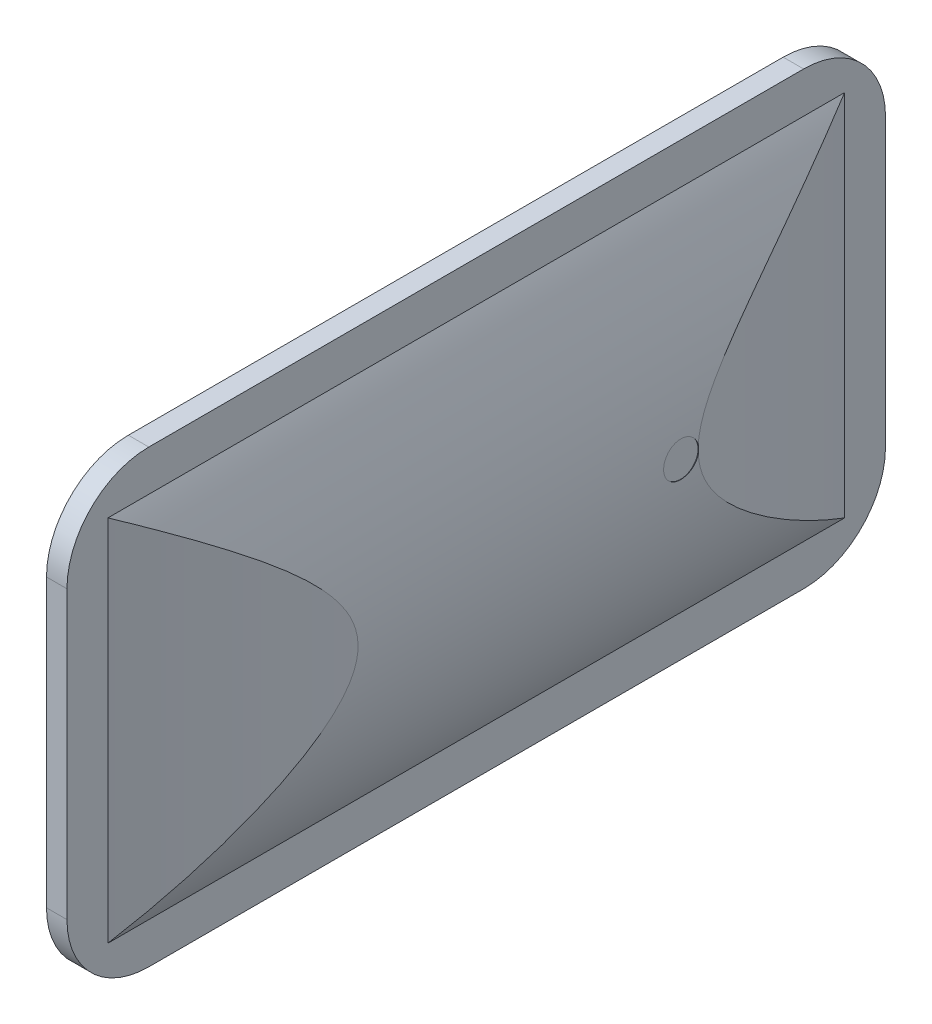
ISO-10303-21;
HEADER;
FILE_DESCRIPTION(('STEP AP214'),'2;1');
FILE_NAME('part.step','',(''),(''),'','','');
FILE_SCHEMA(('AUTOMOTIVE_DESIGN { 1 0 10303 214 1 1 1 1 }'));
ENDSEC;
DATA;
#1=APPLICATION_CONTEXT('core data for automotive mechanical design processes');
#2=APPLICATION_PROTOCOL_DEFINITION('international standard','automotive_design',2000,#1);
#3=PRODUCT_CONTEXT('',#1,'mechanical');
#4=PRODUCT('Part','Part','',(#3));
#5=PRODUCT_RELATED_PRODUCT_CATEGORY('part','',(#4));
#6=PRODUCT_DEFINITION_FORMATION('','',#4);
#7=PRODUCT_DEFINITION_CONTEXT('part definition',#1,'design');
#8=PRODUCT_DEFINITION('design','',#6,#7);
#9=PRODUCT_DEFINITION_SHAPE('','',#8);
#10=(LENGTH_UNIT() NAMED_UNIT(*) SI_UNIT(.MILLI.,.METRE.));
#11=(NAMED_UNIT(*) PLANE_ANGLE_UNIT() SI_UNIT($,.RADIAN.));
#12=(NAMED_UNIT(*) SI_UNIT($,.STERADIAN.) SOLID_ANGLE_UNIT());
#13=UNCERTAINTY_MEASURE_WITH_UNIT(LENGTH_MEASURE(1.E-05),#10,'distance_accuracy_value','');
#14=(GEOMETRIC_REPRESENTATION_CONTEXT(3) GLOBAL_UNCERTAINTY_ASSIGNED_CONTEXT((#13)) GLOBAL_UNIT_ASSIGNED_CONTEXT((#10,
#11,#12)) REPRESENTATION_CONTEXT('',''));
#15=CARTESIAN_POINT('',(0.,0.,0.));
#16=DIRECTION('',(0.,0.,1.));
#17=DIRECTION('',(1.,0.,0.));
#18=AXIS2_PLACEMENT_3D('',#15,#16,#17);
#19=CARTESIAN_POINT('',(-90.1804598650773,69.8499999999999,254.));
#20=DIRECTION('',(0.,0.,-1.));
#21=DIRECTION('',(-1.,0.,0.));
#22=AXIS2_PLACEMENT_3D('',#19,#20,#21);
#23=CYLINDRICAL_SURFACE('',#22,109.459418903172);
#24=CARTESIAN_POINT('',(19.2789590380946,69.85,84.9582497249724));
#25=CARTESIAN_POINT('',(19.2789592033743,70.0033260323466,84.95825092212));
#26=CARTESIAN_POINT('',(19.2786362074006,70.156632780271,84.9517898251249));
#27=CARTESIAN_POINT('',(19.2773535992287,70.4622063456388,84.925991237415));
#28=CARTESIAN_POINT('',(19.2763938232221,70.6144728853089,84.9066504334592));
#29=CARTESIAN_POINT('',(19.2738633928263,70.9169622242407,84.855203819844));
#30=CARTESIAN_POINT('',(19.2722922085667,71.067183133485,84.8230869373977));
#31=CARTESIAN_POINT('',(19.2685829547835,71.364435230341,84.7463047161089));
#32=CARTESIAN_POINT('',(19.2664446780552,71.5114652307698,84.701634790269));
#33=CARTESIAN_POINT('',(19.2616642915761,71.8011046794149,84.6001156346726));
#34=CARTESIAN_POINT('',(19.2590226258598,71.9437178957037,84.5432771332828));
#35=CARTESIAN_POINT('',(19.2533080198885,72.223699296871,84.4177797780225));
#36=CARTESIAN_POINT('',(19.2502349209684,72.3610655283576,84.3491165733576));
#37=CARTESIAN_POINT('',(19.2437472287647,72.6294419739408,84.2005183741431));
#38=CARTESIAN_POINT('',(19.2403328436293,72.7604559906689,84.1205902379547));
#39=CARTESIAN_POINT('',(19.2332563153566,73.0153374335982,83.9499666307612));
#40=CARTESIAN_POINT('',(19.2295940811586,73.1392022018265,83.8592671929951));
#41=CARTESIAN_POINT('',(19.222124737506,73.3789176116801,83.6677187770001));
#42=CARTESIAN_POINT('',(19.2183175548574,73.4947641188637,83.5668646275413));
#43=CARTESIAN_POINT('',(19.2106665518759,73.7175940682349,83.3557215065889));
#44=CARTESIAN_POINT('',(19.2068227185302,73.8245742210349,83.2454290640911));
#45=CARTESIAN_POINT('',(19.1992100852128,74.0288315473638,83.0162609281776));
#46=CARTESIAN_POINT('',(19.1954412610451,74.1261118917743,82.8973880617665));
#47=CARTESIAN_POINT('',(19.1880828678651,74.3103534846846,82.6518239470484));
#48=CARTESIAN_POINT('',(19.1844933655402,74.3973109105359,82.525129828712));
#49=CARTESIAN_POINT('',(19.1775965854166,74.5602580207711,82.2648421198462));
#50=CARTESIAN_POINT('',(19.1742893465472,74.6362461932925,82.1312475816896));
#51=CARTESIAN_POINT('',(19.1680504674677,74.7767250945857,81.858076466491));
#52=CARTESIAN_POINT('',(19.1651189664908,74.841211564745,81.7184976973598));
#53=CARTESIAN_POINT('',(19.1597176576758,74.9581703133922,81.4344353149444));
#54=CARTESIAN_POINT('',(19.157247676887,75.0106470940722,81.2899535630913));
#55=CARTESIAN_POINT('',(19.1528369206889,75.1032576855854,80.9970633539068));
#56=CARTESIAN_POINT('',(19.1508963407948,75.1433869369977,80.8486534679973));
#57=CARTESIAN_POINT('',(19.1459631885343,75.2446683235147,80.3994659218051));
#58=CARTESIAN_POINT('',(19.1438483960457,75.2869403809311,80.0941792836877));
#59=CARTESIAN_POINT('',(19.1422182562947,75.319612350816,79.4810020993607));
#60=CARTESIAN_POINT('',(19.142702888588,75.3100126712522,79.1731115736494));
#61=CARTESIAN_POINT('',(19.1462106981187,75.239316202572,78.5635535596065));
#62=CARTESIAN_POINT('',(19.1492316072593,75.1782654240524,78.2618807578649));
#63=CARTESIAN_POINT('',(19.1574690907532,75.0064531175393,77.6730825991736));
#64=CARTESIAN_POINT('',(19.1626856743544,74.8956913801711,77.3859573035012));
#65=CARTESIAN_POINT('',(19.1747288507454,74.6275535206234,76.834241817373));
#66=CARTESIAN_POINT('',(19.1815561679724,74.4701564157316,76.5696618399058));
#67=CARTESIAN_POINT('',(19.1960506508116,74.1132297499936,76.0706630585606));
#68=CARTESIAN_POINT('',(19.2037178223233,73.9136998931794,75.8362444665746));
#69=CARTESIAN_POINT('',(19.2190379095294,73.4779122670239,75.403953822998));
#70=CARTESIAN_POINT('',(19.2266908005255,73.2416146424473,75.2061219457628));
#71=CARTESIAN_POINT('',(19.2411117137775,72.7391390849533,74.8529303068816));
#72=CARTESIAN_POINT('',(19.2478797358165,72.4729611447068,74.6975705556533));
#73=CARTESIAN_POINT('',(19.2597684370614,71.9182573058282,74.4337370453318));
#74=CARTESIAN_POINT('',(19.2648890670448,71.629730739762,74.3252646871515));
#75=CARTESIAN_POINT('',(19.2729051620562,71.0385302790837,74.1583113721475));
#76=CARTESIAN_POINT('',(19.2758006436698,70.7358564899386,74.099830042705));
#77=CARTESIAN_POINT('',(19.2790379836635,70.1253021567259,74.0345683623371));
#78=CARTESIAN_POINT('',(19.2793825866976,69.8174275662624,74.0277324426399));
#79=CARTESIAN_POINT('',(19.2774866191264,69.2049044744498,74.0658106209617));
#80=CARTESIAN_POINT('',(19.2752460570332,68.900255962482,74.1107245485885));
#81=CARTESIAN_POINT('',(19.2684338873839,68.3029885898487,74.2509814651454));
#82=CARTESIAN_POINT('',(19.2638634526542,68.0103637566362,74.3462990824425));
#83=CARTESIAN_POINT('',(19.252906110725,67.4452663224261,74.5846320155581));
#84=CARTESIAN_POINT('',(19.2465191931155,67.1727938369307,74.7276476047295));
#85=CARTESIAN_POINT('',(19.232640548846,66.6554804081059,75.0574587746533));
#86=CARTESIAN_POINT('',(19.2251478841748,66.4106632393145,75.2442916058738));
#87=CARTESIAN_POINT('',(19.2099047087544,65.9558490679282,75.6563804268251));
#88=CARTESIAN_POINT('',(19.202154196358,65.7458522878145,75.8816366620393));
#89=CARTESIAN_POINT('',(19.187261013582,65.3664524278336,76.3644130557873));
#90=CARTESIAN_POINT('',(19.1801188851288,65.1970853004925,76.6219614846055));
#91=CARTESIAN_POINT('',(19.1672565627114,64.9039998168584,77.1618837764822));
#92=CARTESIAN_POINT('',(19.161536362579,64.7802812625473,77.4442575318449));
#93=CARTESIAN_POINT('',(19.1521660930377,64.5820614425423,78.0256248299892));
#94=CARTESIAN_POINT('',(19.1485150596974,64.5075372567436,78.324610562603));
#95=CARTESIAN_POINT('',(19.143694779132,64.4097693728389,78.9310364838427));
#96=CARTESIAN_POINT('',(19.1425255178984,64.3865253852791,79.2384766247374));
#97=CARTESIAN_POINT('',(19.1427248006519,64.3905553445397,79.6988186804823));
#98=CARTESIAN_POINT('',(19.1431167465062,64.3983811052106,79.852128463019));
#99=CARTESIAN_POINT('',(19.1445354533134,64.4268986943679,80.1575284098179));
#100=CARTESIAN_POINT('',(19.1455619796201,64.4475857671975,80.3096190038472));
#101=CARTESIAN_POINT('',(19.1482222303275,64.5016937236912,80.6115595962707));
#102=CARTESIAN_POINT('',(19.1498561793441,64.535119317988,80.7614087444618));
#103=CARTESIAN_POINT('',(19.1536837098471,64.6144472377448,81.0577036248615));
#104=CARTESIAN_POINT('',(19.1558770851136,64.6603449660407,81.2041505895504));
#105=CARTESIAN_POINT('',(19.1607624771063,64.7643152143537,81.4927096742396));
#106=CARTESIAN_POINT('',(19.1634546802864,64.8223922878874,81.6348201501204));
#107=CARTESIAN_POINT('',(19.1692596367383,64.950273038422,81.9135908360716));
#108=CARTESIAN_POINT('',(19.1723722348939,65.0200723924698,82.0502530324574));
#109=CARTESIAN_POINT('',(19.1789316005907,65.1709418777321,82.3172599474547));
#110=CARTESIAN_POINT('',(19.1823784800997,65.2520157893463,82.4476025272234));
#111=CARTESIAN_POINT('',(19.1895065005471,65.4248090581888,82.7009520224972));
#112=CARTESIAN_POINT('',(19.193187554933,65.5165244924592,82.8239616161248));
#113=CARTESIAN_POINT('',(19.2006859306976,65.7101059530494,83.0619885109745));
#114=CARTESIAN_POINT('',(19.2045034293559,65.8119855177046,83.1769947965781));
#115=CARTESIAN_POINT('',(19.2121602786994,66.0250295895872,83.3979764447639));
#116=CARTESIAN_POINT('',(19.2159996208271,66.1361906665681,83.5039551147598));
#117=CARTESIAN_POINT('',(19.2235950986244,66.3671140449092,83.7062403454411));
#118=CARTESIAN_POINT('',(19.2273511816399,66.4868815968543,83.8025409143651));
#119=CARTESIAN_POINT('',(19.2346697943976,66.7340623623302,83.9846780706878));
#120=CARTESIAN_POINT('',(19.2382323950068,66.8614727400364,84.0705185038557));
#121=CARTESIAN_POINT('',(19.2450690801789,67.1232502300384,84.2312733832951));
#122=CARTESIAN_POINT('',(19.2483427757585,67.2576263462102,84.3061731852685));
#123=CARTESIAN_POINT('',(19.2545021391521,67.5321728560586,84.4443506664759));
#124=CARTESIAN_POINT('',(19.2573879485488,67.6723411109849,84.50763258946));
#125=CARTESIAN_POINT('',(19.2626886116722,67.9573997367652,84.6221061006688));
#126=CARTESIAN_POINT('',(19.2651038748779,68.1022858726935,84.6733082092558));
#127=CARTESIAN_POINT('',(19.2693975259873,68.39581557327,84.7633140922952));
#128=CARTESIAN_POINT('',(19.2712760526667,68.5444581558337,84.8021210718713));
#129=CARTESIAN_POINT('',(19.2748615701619,68.8841244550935,84.8756541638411));
#130=CARTESIAN_POINT('',(19.2763924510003,69.0759801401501,84.9066003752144));
#131=CARTESIAN_POINT('',(19.2784410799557,69.4619008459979,84.9478973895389));
#132=CARTESIAN_POINT('',(19.2789588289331,69.6559658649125,84.9582482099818));
#133=CARTESIAN_POINT('',(19.2789590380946,69.85,84.9582497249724));
#134=B_SPLINE_CURVE_WITH_KNOTS('',3,(#24,#25,#26,#27,#28,#29,#30,#31,#32,#33,#34,#35,#36,#37,
#38,#39,#40,#41,#42,#43,#44,#45,#46,#47,#48,#49,#50,#51,#52,#53,#54,#55,#56,#57,#58,#59,#60,#61,
#62,#63,#64,#65,#66,#67,#68,#69,#70,#71,#72,#73,#74,#75,#76,#77,#78,#79,#80,#81,#82,#83,#84,#85,
#86,#87,#88,#89,#90,#91,#92,#93,#94,#95,#96,#97,#98,#99,#100,#101,#102,#103,#104,#105,#106,#107,
#108,#109,#110,#111,#112,#113,#114,#115,#116,#117,#118,#119,#120,#121,#122,#123,#124,#125,#126,
#127,#128,#129,#130,#131,#132,#133),.UNSPECIFIED.,.T.,.F.,(4,2,2,2,2,2,2,2,2,2,2,2,2,2,2,2,2,2,
2,2,2,2,2,2,2,2,2,2,2,2,2,2,2,2,2,2,2,2,2,2,2,2,2,2,2,2,2,2,2,2,2,2,2,2,4),(0.,
0.459808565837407,0.919735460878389,1.38006183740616,1.8405566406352,2.30064711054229,
2.76090722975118,3.22088833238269,3.68103936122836,4.14142591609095,4.60198251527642,
5.06238806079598,5.52296356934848,5.98360249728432,6.44441162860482,6.90504772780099,
7.36585371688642,8.28570075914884,9.2055405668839,10.1245586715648,11.0435806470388,
11.9630167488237,12.8824593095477,13.8029055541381,14.7233520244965,15.6438259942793,
16.5642931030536,17.48376967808,18.4032432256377,19.3222543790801,20.2412707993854,
21.161071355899,22.080877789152,23.0014951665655,23.9221085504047,24.8422927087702,
25.7624716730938,26.2225538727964,26.6824660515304,27.1425484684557,27.6024615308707,
28.0625468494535,28.522462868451,28.9825334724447,29.4424350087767,29.9029575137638,
30.3633105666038,30.823946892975,31.2844133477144,31.7454906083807,32.2063991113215,
32.6669047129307,33.1272911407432,33.7091794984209,34.2910673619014),.UNSPECIFIED.);
#135=CARTESIAN_POINT('',(19.2715583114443,68.5771670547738,74.1866549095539));
#136=VERTEX_POINT('',#135);
#137=CARTESIAN_POINT('',(19.2715583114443,71.1228329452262,74.1866549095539));
#138=VERTEX_POINT('',#137);
#139=EDGE_CURVE('E131',#136,#138,#134,.T.);
#140=ORIENTED_EDGE('',*,*,#139,.T.);
#141=CARTESIAN_POINT('',(3.17500000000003,127.,12.7));
#142=CARTESIAN_POINT('',(3.57957955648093,126.339098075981,13.8012677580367));
#143=CARTESIAN_POINT('',(3.97739802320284,125.67350898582,14.9022068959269));
#144=CARTESIAN_POINT('',(4.75955150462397,124.332671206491,17.1030035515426));
#145=CARTESIAN_POINT('',(5.1438864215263,123.657422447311,18.2028610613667));
#146=CARTESIAN_POINT('',(5.89917657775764,122.296861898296,20.4012605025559));
#147=CARTESIAN_POINT('',(6.27012929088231,121.61154824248,21.4998021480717));
#148=CARTESIAN_POINT('',(6.99859959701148,120.230591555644,23.6948261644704));
#149=CARTESIAN_POINT('',(7.3561172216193,119.534948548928,24.7913085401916));
#150=CARTESIAN_POINT('',(8.40586509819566,117.437204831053,28.0684546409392));
#151=CARTESIAN_POINT('',(9.07820427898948,116.019045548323,30.2453093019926));
#152=CARTESIAN_POINT('',(10.0467356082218,113.855648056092,33.4981939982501));
#153=CARTESIAN_POINT('',(10.362906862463,113.128513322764,34.5803877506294));
#154=CARTESIAN_POINT('',(10.9819155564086,111.661151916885,36.7396988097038));
#155=CARTESIAN_POINT('',(11.2847531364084,110.920925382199,37.8168161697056));
#156=CARTESIAN_POINT('',(11.9654387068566,109.203141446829,40.2853629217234));
#157=CARTESIAN_POINT('',(12.3386991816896,108.220686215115,41.6746576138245));
#158=CARTESIAN_POINT('',(13.0625048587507,106.228266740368,44.4395152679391));
#159=CARTESIAN_POINT('',(13.4130489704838,105.218301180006,45.8150775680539));
#160=CARTESIAN_POINT('',(14.0923398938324,103.162520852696,48.55292157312));
#161=CARTESIAN_POINT('',(14.4210016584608,102.116587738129,49.915135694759));
#162=CARTESIAN_POINT('',(15.0545559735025,99.9862192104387,52.6145850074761));
#163=CARTESIAN_POINT('',(15.3594524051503,98.9017901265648,53.9518242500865));
#164=CARTESIAN_POINT('',(15.7994847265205,97.2351881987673,55.9370250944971));
#165=CARTESIAN_POINT('',(15.943803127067,96.6707234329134,56.5978414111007));
#166=CARTESIAN_POINT('',(16.2260229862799,95.5282252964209,57.9090154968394));
#167=CARTESIAN_POINT('',(16.3639246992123,94.950192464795,58.5593736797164));
#168=CARTESIAN_POINT('',(16.6332231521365,93.7782946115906,59.84814113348));
#169=CARTESIAN_POINT('',(16.7646140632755,93.1844161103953,60.4865393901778));
#170=CARTESIAN_POINT('',(17.0204704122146,91.979266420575,61.7480787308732));
#171=CARTESIAN_POINT('',(17.1449363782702,91.3679965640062,62.3712209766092));
#172=CARTESIAN_POINT('',(17.3861126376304,90.1279281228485,63.5964785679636));
#173=CARTESIAN_POINT('',(17.5028509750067,89.499206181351,64.1986657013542));
#174=CARTESIAN_POINT('',(17.7286084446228,88.2189947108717,65.3801263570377));
#175=CARTESIAN_POINT('',(17.8376265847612,87.5675022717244,65.9593969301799));
#176=CARTESIAN_POINT('',(18.0470807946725,86.2394809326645,67.0881125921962));
#177=CARTESIAN_POINT('',(18.1475298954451,85.5629923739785,67.637602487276));
#178=CARTESIAN_POINT('',(18.3390722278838,84.1804730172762,68.6996304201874));
#179=CARTESIAN_POINT('',(18.4301689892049,83.4744535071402,69.2121823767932));
#180=CARTESIAN_POINT('',(18.584119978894,82.1773993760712,70.0893298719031));
#181=CARTESIAN_POINT('',(18.6489313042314,81.5925451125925,70.4626872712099));
#182=CARTESIAN_POINT('',(18.7710200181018,80.3998246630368,71.1725501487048));
#183=CARTESIAN_POINT('',(18.8282964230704,79.791955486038,71.5090508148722));
#184=CARTESIAN_POINT('',(18.9341166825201,78.5539347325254,72.1358591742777));
#185=CARTESIAN_POINT('',(18.982683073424,77.923845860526,72.4262858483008));
#186=CARTESIAN_POINT('',(19.0700151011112,76.6405095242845,72.9520650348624));
#187=CARTESIAN_POINT('',(19.1087865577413,75.9872760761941,73.1874502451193));
#188=CARTESIAN_POINT('',(19.1665547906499,74.8335554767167,73.539915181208));
#189=CARTESIAN_POINT('',(19.1880715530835,74.3377225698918,73.6718374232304));
#190=CARTESIAN_POINT('',(19.2245430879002,73.3371257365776,73.8960535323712));
#191=CARTESIAN_POINT('',(19.2395015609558,72.8323670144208,73.9883697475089));
#192=CARTESIAN_POINT('',(19.2624642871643,71.8168615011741,74.1302911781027));
#193=CARTESIAN_POINT('',(19.2704711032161,71.3061169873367,74.1799121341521));
#194=CARTESIAN_POINT('',(19.2793032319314,70.2821547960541,74.2346561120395));
#195=CARTESIAN_POINT('',(19.2801284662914,69.7689370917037,74.2397786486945));
#196=CARTESIAN_POINT('',(19.2745701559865,68.743802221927,74.2053164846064));
#197=CARTESIAN_POINT('',(19.2681830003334,68.2318858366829,74.1657093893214));
#198=CARTESIAN_POINT('',(19.2483865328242,67.2134414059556,74.0432499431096));
#199=CARTESIAN_POINT('',(19.2349771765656,66.7069133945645,73.9603973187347));
#200=CARTESIAN_POINT('',(19.2014980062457,65.7021658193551,73.7542857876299));
#201=CARTESIAN_POINT('',(19.1814247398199,65.2039507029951,73.6310059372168));
#202=CARTESIAN_POINT('',(19.1351003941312,64.2182745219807,73.3478258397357));
#203=CARTESIAN_POINT('',(19.1088472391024,63.7308171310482,73.1879132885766));
#204=CARTESIAN_POINT('',(19.0349511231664,62.5076191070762,72.7402935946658));
#205=CARTESIAN_POINT('',(18.9834208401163,61.7802571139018,72.4302578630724));
#206=CARTESIAN_POINT('',(18.8688157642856,60.3562594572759,71.7480289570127));
#207=CARTESIAN_POINT('',(18.8057335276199,59.6596439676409,71.3757957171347));
#208=CARTESIAN_POINT('',(18.6693959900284,58.2937884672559,70.5807377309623));
#209=CARTESIAN_POINT('',(18.5961044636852,57.6246574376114,70.1577336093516));
#210=CARTESIAN_POINT('',(18.4408228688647,56.3142548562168,69.2727662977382));
#211=CARTESIAN_POINT('',(18.3588350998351,55.672976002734,68.810813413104));
#212=CARTESIAN_POINT('',(18.1430424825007,54.0922339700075,67.6108879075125));
#213=CARTESIAN_POINT('',(18.0042402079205,53.1686571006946,66.8529384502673));
#214=CARTESIAN_POINT('',(17.7112193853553,51.3680688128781,65.2860597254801));
#215=CARTESIAN_POINT('',(17.5569916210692,50.4910857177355,64.477100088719));
#216=CARTESIAN_POINT('',(17.2343379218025,48.7741868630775,62.8200535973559));
#217=CARTESIAN_POINT('',(17.0658825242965,47.9343537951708,61.9718872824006));
#218=CARTESIAN_POINT('',(16.7161070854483,46.2873884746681,60.2474720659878));
#219=CARTESIAN_POINT('',(16.5347898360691,45.48024918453,59.371229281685));
#220=CARTESIAN_POINT('',(16.1583755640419,43.886715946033,57.5895844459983));
#221=CARTESIAN_POINT('',(15.9631765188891,43.1005502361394,56.6840005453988));
#222=CARTESIAN_POINT('',(15.5608211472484,41.5518401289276,54.8554491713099));
#223=CARTESIAN_POINT('',(15.353664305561,40.789296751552,53.9324809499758));
#224=CARTESIAN_POINT('',(14.9279965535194,39.2855341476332,52.0739000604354));
#225=CARTESIAN_POINT('',(14.7095000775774,38.5442895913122,51.138304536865));
#226=CARTESIAN_POINT('',(14.2611437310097,37.0795521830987,49.255991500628));
#227=CARTESIAN_POINT('',(14.0312835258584,36.356059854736,48.3092736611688));
#228=CARTESIAN_POINT('',(13.4435001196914,34.5695388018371,45.9346807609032));
#229=CARTESIAN_POINT('',(13.078640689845,33.5162183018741,44.5012139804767));
#230=CARTESIAN_POINT('',(12.3242134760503,31.4393712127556,41.6192623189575));
#231=CARTESIAN_POINT('',(11.9346447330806,30.4158457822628,40.170776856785));
#232=CARTESIAN_POINT('',(11.1307624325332,28.3941852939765,37.2616425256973));
#233=CARTESIAN_POINT('',(10.7164339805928,27.3960660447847,35.8009867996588));
#234=CARTESIAN_POINT('',(9.86334614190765,25.423022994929,32.8711699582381));
#235=CARTESIAN_POINT('',(9.42458656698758,24.4480993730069,31.4020087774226));
#236=CARTESIAN_POINT('',(8.53613541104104,22.5481520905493,28.5012985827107));
#237=CARTESIAN_POINT('',(8.08716121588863,21.6225076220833,27.0699360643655));
#238=CARTESIAN_POINT('',(7.16623617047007,19.7896676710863,24.2027906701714));
#239=CARTESIAN_POINT('',(6.69428518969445,18.8824722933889,22.7670077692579));
#240=CARTESIAN_POINT('',(5.727867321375,17.0864108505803,19.8938065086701));
#241=CARTESIAN_POINT('',(5.23342431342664,16.1975267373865,18.4563913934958));
#242=CARTESIAN_POINT('',(4.22150617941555,14.4364356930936,15.5794955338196));
#243=CARTESIAN_POINT('',(3.70403151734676,13.5642284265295,14.1400148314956));
#244=CARTESIAN_POINT('',(3.17500000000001,12.7,12.7000000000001));
#245=B_SPLINE_CURVE_WITH_KNOTS('',3,(#141,#142,#143,#144,#145,#146,#147,#148,#149,#150,#151,
#152,#153,#154,#155,#156,#157,#158,#159,#160,#161,#162,#163,#164,#165,#166,#167,#168,#169,#170,
#171,#172,#173,#174,#175,#176,#177,#178,#179,#180,#181,#182,#183,#184,#185,#186,#187,#188,#189,
#190,#191,#192,#193,#194,#195,#196,#197,#198,#199,#200,#201,#202,#203,#204,#205,#206,#207,#208,
#209,#210,#211,#212,#213,#214,#215,#216,#217,#218,#219,#220,#221,#222,#223,#224,#225,#226,#227,
#228,#229,#230,#231,#232,#233,#234,#235,#236,#237,#238,#239,#240,#241,#242,#243,#244),
.UNSPECIFIED.,.F.,.F.,(4,2,2,2,2,2,2,2,2,2,2,2,2,2,2,2,2,2,2,2,2,2,2,2,2,2,2,2,2,2,2,2,2,2,2,2,
2,2,2,2,2,2,2,2,2,2,2,2,2,2,2,4),(0.,4.03970209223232,8.07943347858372,12.1199235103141,
16.1604040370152,24.2101818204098,28.2348094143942,32.2593946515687,37.485113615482,
42.7110832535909,47.9563028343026,53.200663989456,55.843453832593,58.486138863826,
61.1311485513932,63.7759561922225,66.4105697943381,69.0455213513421,71.6763917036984,
74.3062654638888,76.3957846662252,78.485576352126,80.5698803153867,82.6529429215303,
84.1920815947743,85.7303506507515,87.2680523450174,88.8057708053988,90.3442594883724,
91.8827578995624,93.4220546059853,94.9618690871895,97.3348906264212,99.7094467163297,
102.092653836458,104.475232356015,108.08067044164,111.688275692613,115.303543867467,
118.918029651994,122.562563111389,126.207253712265,129.847413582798,133.4876806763,
138.934747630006,144.382026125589,149.832615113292,155.283246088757,160.57115798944,
165.859099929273,171.141553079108,176.42389985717),.UNSPECIFIED.);
#246=CARTESIAN_POINT('',(3.17500000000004,127.,12.7));
#247=VERTEX_POINT('',#246);
#248=EDGE_CURVE('E139',#247,#138,#245,.T.);
#249=ORIENTED_EDGE('',*,*,#248,.F.);
#250=DIRECTION('',(0.,0.,-1.));
#251=VECTOR('',#250,1.);
#252=CARTESIAN_POINT('',(3.17500000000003,127.,254.));
#253=LINE('',#252,#251);
#254=CARTESIAN_POINT('',(3.17500000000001,127.,241.3));
#255=VERTEX_POINT('',#254);
#256=EDGE_CURVE('E380',#255,#247,#253,.T.);
#257=ORIENTED_EDGE('',*,*,#256,.F.);
#258=CARTESIAN_POINT('',(3.17500000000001,12.7,241.3));
#259=CARTESIAN_POINT('',(3.57957955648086,13.3609019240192,240.198732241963));
#260=CARTESIAN_POINT('',(3.97739802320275,14.0264910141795,239.097793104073));
#261=CARTESIAN_POINT('',(4.7595515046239,15.3673287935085,236.896996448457));
#262=CARTESIAN_POINT('',(5.14388642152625,16.0425775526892,235.797138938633));
#263=CARTESIAN_POINT('',(5.89917657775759,17.4031381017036,233.598739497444));
#264=CARTESIAN_POINT('',(6.27012929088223,18.0884517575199,232.500197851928));
#265=CARTESIAN_POINT('',(6.99859959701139,19.4694084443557,230.305173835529));
#266=CARTESIAN_POINT('',(7.35611722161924,20.1650514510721,229.208691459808));
#267=CARTESIAN_POINT('',(8.40586509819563,22.2627951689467,225.931545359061));
#268=CARTESIAN_POINT('',(9.07820427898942,23.6809544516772,223.754690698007));
#269=CARTESIAN_POINT('',(10.0467356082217,25.8443519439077,220.50180600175));
#270=CARTESIAN_POINT('',(10.362906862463,26.5714866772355,219.41961224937));
#271=CARTESIAN_POINT('',(10.9819155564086,28.0388480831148,217.260301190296));
#272=CARTESIAN_POINT('',(11.2847531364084,28.7790746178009,216.183183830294));
#273=CARTESIAN_POINT('',(11.9654387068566,30.496858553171,213.714637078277));
#274=CARTESIAN_POINT('',(12.3386991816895,31.4793137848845,212.325342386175));
#275=CARTESIAN_POINT('',(13.0625048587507,33.4717332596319,209.560484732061));
#276=CARTESIAN_POINT('',(13.4130489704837,34.4816988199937,208.184922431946));
#277=CARTESIAN_POINT('',(14.0923398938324,36.5374791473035,205.44707842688));
#278=CARTESIAN_POINT('',(14.4210016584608,37.5834122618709,204.084864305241));
#279=CARTESIAN_POINT('',(15.0545559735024,39.713780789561,201.385414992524));
#280=CARTESIAN_POINT('',(15.3594524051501,40.7982098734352,200.048175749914));
#281=CARTESIAN_POINT('',(15.7994847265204,42.4648118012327,198.062974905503));
#282=CARTESIAN_POINT('',(15.943803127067,43.0292765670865,197.402158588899));
#283=CARTESIAN_POINT('',(16.2260229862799,44.1717747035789,196.09098450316));
#284=CARTESIAN_POINT('',(16.3639246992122,44.7498075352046,195.440626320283));
#285=CARTESIAN_POINT('',(16.6332231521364,45.921705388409,194.15185886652));
#286=CARTESIAN_POINT('',(16.7646140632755,46.5155838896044,193.513460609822));
#287=CARTESIAN_POINT('',(17.0204704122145,47.7207335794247,192.251921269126));
#288=CARTESIAN_POINT('',(17.1449363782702,48.3320034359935,191.62877902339));
#289=CARTESIAN_POINT('',(17.3861126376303,49.5720718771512,190.403521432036));
#290=CARTESIAN_POINT('',(17.5028509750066,50.2007938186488,189.801334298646));
#291=CARTESIAN_POINT('',(17.7286084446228,51.481005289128,188.619873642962));
#292=CARTESIAN_POINT('',(17.8376265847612,52.1324977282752,188.04060306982));
#293=CARTESIAN_POINT('',(18.0470807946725,53.460519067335,186.911887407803));
#294=CARTESIAN_POINT('',(18.147529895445,54.1370076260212,186.362397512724));
#295=CARTESIAN_POINT('',(18.3390722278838,55.5195269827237,185.300369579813));
#296=CARTESIAN_POINT('',(18.4301689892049,56.2255464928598,184.787817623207));
#297=CARTESIAN_POINT('',(18.584119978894,57.5226006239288,183.910670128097));
#298=CARTESIAN_POINT('',(18.6489313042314,58.1074548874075,183.53731272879));
#299=CARTESIAN_POINT('',(18.7710200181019,59.3001753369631,182.827449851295));
#300=CARTESIAN_POINT('',(18.8282964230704,59.9080445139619,182.490949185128));
#301=CARTESIAN_POINT('',(18.9341166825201,61.1460652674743,181.864140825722));
#302=CARTESIAN_POINT('',(18.982683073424,61.7761541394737,181.573714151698));
#303=CARTESIAN_POINT('',(19.0700151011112,63.0594904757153,181.047934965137));
#304=CARTESIAN_POINT('',(19.1087865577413,63.7127239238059,180.812549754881));
#305=CARTESIAN_POINT('',(19.1665547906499,64.8664445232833,180.460084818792));
#306=CARTESIAN_POINT('',(19.1880715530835,65.3622774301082,180.328162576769));
#307=CARTESIAN_POINT('',(19.2245430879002,66.3628742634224,180.103946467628));
#308=CARTESIAN_POINT('',(19.2395015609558,66.8676329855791,180.011630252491));
#309=CARTESIAN_POINT('',(19.2624642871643,67.8831384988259,179.869708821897));
#310=CARTESIAN_POINT('',(19.2704711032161,68.3938830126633,179.820087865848));
#311=CARTESIAN_POINT('',(19.2793032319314,69.4178452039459,179.76534388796));
#312=CARTESIAN_POINT('',(19.2801284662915,69.9310629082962,179.760221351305));
#313=CARTESIAN_POINT('',(19.2745701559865,70.956197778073,179.794683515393));
#314=CARTESIAN_POINT('',(19.2681830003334,71.4681141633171,179.834290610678));
#315=CARTESIAN_POINT('',(19.2483865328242,72.4865585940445,179.95675005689));
#316=CARTESIAN_POINT('',(19.2349771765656,72.9930866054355,180.039602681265));
#317=CARTESIAN_POINT('',(19.2014980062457,73.997834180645,180.24571421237));
#318=CARTESIAN_POINT('',(19.1814247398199,74.496049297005,180.368994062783));
#319=CARTESIAN_POINT('',(19.1351003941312,75.4817254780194,180.652174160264));
#320=CARTESIAN_POINT('',(19.1088472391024,75.9691828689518,180.812086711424));
#321=CARTESIAN_POINT('',(19.0349511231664,77.1923808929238,181.259706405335));
#322=CARTESIAN_POINT('',(18.9834208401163,77.9197428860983,181.569742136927));
#323=CARTESIAN_POINT('',(18.8688157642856,79.3437405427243,182.251971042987));
#324=CARTESIAN_POINT('',(18.8057335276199,80.0403560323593,182.624204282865));
#325=CARTESIAN_POINT('',(18.6693959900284,81.4062115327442,183.419262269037));
#326=CARTESIAN_POINT('',(18.5961044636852,82.0753425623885,183.842266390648));
#327=CARTESIAN_POINT('',(18.4408228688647,83.385745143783,184.727233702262));
#328=CARTESIAN_POINT('',(18.3588350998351,84.0270239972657,185.189186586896));
#329=CARTESIAN_POINT('',(18.1430424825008,85.6077660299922,186.389112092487));
#330=CARTESIAN_POINT('',(18.0042402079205,86.5313428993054,187.147061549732));
#331=CARTESIAN_POINT('',(17.7112193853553,88.3319311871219,188.713940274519));
#332=CARTESIAN_POINT('',(17.5569916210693,89.2089142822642,189.522899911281));
#333=CARTESIAN_POINT('',(17.2343379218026,90.9258131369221,191.179946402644));
#334=CARTESIAN_POINT('',(17.0658825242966,91.7656462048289,192.028112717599));
#335=CARTESIAN_POINT('',(16.7161070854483,93.4126115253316,193.752527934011));
#336=CARTESIAN_POINT('',(16.5347898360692,94.2197508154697,194.628770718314));
#337=CARTESIAN_POINT('',(16.158375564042,95.8132840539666,196.410415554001));
#338=CARTESIAN_POINT('',(15.9631765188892,96.5994497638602,197.3159994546));
#339=CARTESIAN_POINT('',(15.5608211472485,98.1481598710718,199.144550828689));
#340=CARTESIAN_POINT('',(15.3536643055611,98.9107032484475,200.067519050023));
#341=CARTESIAN_POINT('',(14.9279965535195,100.414465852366,201.926099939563));
#342=CARTESIAN_POINT('',(14.7095000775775,101.155710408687,202.861695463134));
#343=CARTESIAN_POINT('',(14.2611437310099,102.620447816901,204.744008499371));
#344=CARTESIAN_POINT('',(14.0312835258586,103.343940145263,205.69072633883));
#345=CARTESIAN_POINT('',(13.4435001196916,105.130461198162,208.065319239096));
#346=CARTESIAN_POINT('',(13.0786406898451,106.183781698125,209.498786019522));
#347=CARTESIAN_POINT('',(12.3242134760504,108.260628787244,212.380737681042));
#348=CARTESIAN_POINT('',(11.9346447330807,109.284154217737,213.829223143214));
#349=CARTESIAN_POINT('',(11.1307624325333,111.305814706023,216.738357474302));
#350=CARTESIAN_POINT('',(10.7164339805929,112.303933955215,218.199013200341));
#351=CARTESIAN_POINT('',(9.86334614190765,114.276977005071,221.128830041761));
#352=CARTESIAN_POINT('',(9.42458656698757,115.251900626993,222.597991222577));
#353=CARTESIAN_POINT('',(8.53613541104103,117.151847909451,225.498701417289));
#354=CARTESIAN_POINT('',(8.08716121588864,118.077492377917,226.930063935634));
#355=CARTESIAN_POINT('',(7.16623617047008,119.910332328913,229.797209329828));
#356=CARTESIAN_POINT('',(6.69428518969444,120.817527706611,231.232992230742));
#357=CARTESIAN_POINT('',(5.72786732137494,122.61358914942,234.10619349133));
#358=CARTESIAN_POINT('',(5.23342431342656,123.502473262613,235.543608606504));
#359=CARTESIAN_POINT('',(4.22150617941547,125.263564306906,238.42050446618));
#360=CARTESIAN_POINT('',(3.7040315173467,126.13577157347,239.859985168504));
#361=CARTESIAN_POINT('',(3.17500000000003,127.,241.3));
#362=B_SPLINE_CURVE_WITH_KNOTS('',3,(#258,#259,#260,#261,#262,#263,#264,#265,#266,#267,#268,
#269,#270,#271,#272,#273,#274,#275,#276,#277,#278,#279,#280,#281,#282,#283,#284,#285,#286,#287,
#288,#289,#290,#291,#292,#293,#294,#295,#296,#297,#298,#299,#300,#301,#302,#303,#304,#305,#306,
#307,#308,#309,#310,#311,#312,#313,#314,#315,#316,#317,#318,#319,#320,#321,#322,#323,#324,#325,
#326,#327,#328,#329,#330,#331,#332,#333,#334,#335,#336,#337,#338,#339,#340,#341,#342,#343,#344,
#345,#346,#347,#348,#349,#350,#351,#352,#353,#354,#355,#356,#357,#358,#359,#360,#361),
.UNSPECIFIED.,.F.,.F.,(4,2,2,2,2,2,2,2,2,2,2,2,2,2,2,2,2,2,2,2,2,2,2,2,2,2,2,2,2,2,2,2,2,2,2,2,
2,2,2,2,2,2,2,2,2,2,2,2,2,2,2,4),(0.,4.03970209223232,8.07943347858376,12.1199235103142,
16.1604040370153,24.2101818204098,28.2348094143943,32.2593946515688,37.4851136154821,
42.711083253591,47.9563028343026,53.2006639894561,55.8434538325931,58.4861388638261,
61.1311485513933,63.7759561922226,66.4105697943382,69.0455213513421,71.6763917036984,
74.3062654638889,76.3957846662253,78.4855763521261,80.5698803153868,82.6529429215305,
84.1920815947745,85.7303506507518,87.2680523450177,88.805770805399,90.3442594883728,
91.8827578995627,93.4220546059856,94.96186908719,97.3348906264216,99.70944671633,
102.092653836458,104.475232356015,108.08067044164,111.688275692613,115.303543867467,
118.918029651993,122.562563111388,126.207253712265,129.847413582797,133.487680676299,
138.934747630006,144.382026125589,149.832615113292,155.283246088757,160.57115798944,
165.859099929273,171.141553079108,176.42389985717),.UNSPECIFIED.);
#363=CARTESIAN_POINT('',(3.17500000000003,12.7,241.3));
#364=VERTEX_POINT('',#363);
#365=EDGE_CURVE('E148',#364,#255,#362,.T.);
#366=ORIENTED_EDGE('',*,*,#365,.F.);
#367=DIRECTION('',(0.,0.,-1.));
#368=VECTOR('',#367,1.);
#369=CARTESIAN_POINT('',(3.17499999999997,12.6999999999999,254.));
#370=LINE('',#369,#368);
#371=CARTESIAN_POINT('',(3.17500000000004,12.7,12.7));
#372=VERTEX_POINT('',#371);
#373=EDGE_CURVE('E378',#364,#372,#370,.T.);
#374=ORIENTED_EDGE('',*,*,#373,.T.);
#375=EDGE_CURVE('E142',#136,#372,#245,.T.);
#376=ORIENTED_EDGE('',*,*,#375,.F.);
#377=EDGE_LOOP('',(#140,#249,#257,#366,#374,#376));
#378=FACE_BOUND('',#377,.T.);
#379=ADVANCED_FACE('F31',(#378),#23,.T.);
#380=CARTESIAN_POINT('',(-307.951801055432,0.,127.));
#381=DIRECTION('',(0.,1.,0.));
#382=DIRECTION('',(0.,0.,1.));
#383=AXIS2_PLACEMENT_3D('',#380,#381,#382);
#384=CYLINDRICAL_SURFACE('',#383,331.45795560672);
#385=ORIENTED_EDGE('',*,*,#248,.T.);
#386=CARTESIAN_POINT('',(19.2799590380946,68.3767381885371,74.2387308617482));
#387=CARTESIAN_POINT('',(19.2732871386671,68.5243534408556,74.1973557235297));
#388=CARTESIAN_POINT('',(19.2676145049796,68.6737600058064,74.1622187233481));
#389=CARTESIAN_POINT('',(19.2583076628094,68.9750922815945,74.104611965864));
#390=CARTESIAN_POINT('',(19.2546739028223,69.1270185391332,74.0821449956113));
#391=CARTESIAN_POINT('',(19.2495466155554,69.4287916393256,74.0504519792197));
#392=CARTESIAN_POINT('',(19.2480063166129,69.5786072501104,74.0409365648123));
#393=CARTESIAN_POINT('',(19.2469264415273,69.8784524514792,74.0342651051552));
#394=CARTESIAN_POINT('',(19.2473861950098,70.0284819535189,74.0371049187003));
#395=CARTESIAN_POINT('',(19.2507179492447,70.3703354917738,74.057691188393));
#396=CARTESIAN_POINT('',(19.2542376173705,70.5619350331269,74.0794400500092));
#397=CARTESIAN_POINT('',(19.2619798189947,70.84807389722,74.1273398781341));
#398=CARTESIAN_POINT('',(19.2650031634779,70.943956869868,74.146051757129));
#399=CARTESIAN_POINT('',(19.2718695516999,71.1345477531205,74.188579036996));
#400=CARTESIAN_POINT('',(19.2757125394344,71.2292557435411,74.2123940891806));
#401=CARTESIAN_POINT('',(19.2799590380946,71.323261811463,74.2387308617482));
#402=B_SPLINE_CURVE_WITH_KNOTS('',3,(#386,#387,#388,#389,#390,#391,#392,#393,#394,#395,#396,
#397,#398,#399,#400,#401),.UNSPECIFIED.,.F.,.F.,(4,2,2,2,2,2,2,4),(0.,0.460205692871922,
0.920512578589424,1.37035632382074,1.82004930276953,2.39738631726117,2.69048035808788,
2.98355437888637),.UNSPECIFIED.);
#403=EDGE_CURVE('E128',#136,#138,#402,.T.);
#404=ORIENTED_EDGE('',*,*,#403,.F.);
#405=ORIENTED_EDGE('',*,*,#375,.T.);
#406=DIRECTION('',(0.,1.,0.));
#407=VECTOR('',#406,1.);
#408=CARTESIAN_POINT('',(3.17500000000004,0.,12.7));
#409=LINE('',#408,#407);
#410=EDGE_CURVE('E147',#372,#247,#409,.T.);
#411=ORIENTED_EDGE('',*,*,#410,.T.);
#412=EDGE_LOOP('',(#385,#404,#405,#411));
#413=FACE_BOUND('',#412,.T.);
#414=ADVANCED_FACE('F145',(#413),#384,.T.);
#415=CARTESIAN_POINT('',(90.1804598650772,69.8500000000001,254.));
#416=DIRECTION('',(0.,0.,-1.));
#417=DIRECTION('',(-1.,0.,0.));
#418=AXIS2_PLACEMENT_3D('',#415,#416,#417);
#419=CYLINDRICAL_SURFACE('',#418,109.459418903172);
#420=CARTESIAN_POINT('',(-3.17500000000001,127.,241.3));
#421=CARTESIAN_POINT('',(-3.5795795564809,126.339098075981,240.198732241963));
#422=CARTESIAN_POINT('',(-3.97739802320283,125.67350898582,239.097793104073));
#423=CARTESIAN_POINT('',(-4.759551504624,124.332671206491,236.896996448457));
#424=CARTESIAN_POINT('',(-5.14388642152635,123.657422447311,235.797138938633));
#425=CARTESIAN_POINT('',(-5.89917657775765,122.296861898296,233.598739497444));
#426=CARTESIAN_POINT('',(-6.27012929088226,121.61154824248,232.500197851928));
#427=CARTESIAN_POINT('',(-6.99859959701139,120.230591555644,230.30517383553));
#428=CARTESIAN_POINT('',(-7.35611722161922,119.534948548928,229.208691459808));
#429=CARTESIAN_POINT('',(-8.40586509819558,117.437204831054,225.931545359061));
#430=CARTESIAN_POINT('',(-9.07820427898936,116.019045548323,223.754690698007));
#431=CARTESIAN_POINT('',(-10.0467356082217,113.855648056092,220.50180600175));
#432=CARTESIAN_POINT('',(-10.362906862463,113.128513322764,219.419612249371));
#433=CARTESIAN_POINT('',(-10.9819155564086,111.661151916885,217.260301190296));
#434=CARTESIAN_POINT('',(-11.2847531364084,110.920925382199,216.183183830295));
#435=CARTESIAN_POINT('',(-11.9654387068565,109.203141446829,213.714637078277));
#436=CARTESIAN_POINT('',(-12.3386991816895,108.220686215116,212.325342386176));
#437=CARTESIAN_POINT('',(-13.0625048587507,106.228266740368,209.560484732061));
#438=CARTESIAN_POINT('',(-13.4130489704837,105.218301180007,208.184922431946));
#439=CARTESIAN_POINT('',(-14.0923398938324,103.162520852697,205.44707842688));
#440=CARTESIAN_POINT('',(-14.4210016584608,102.116587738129,204.084864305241));
#441=CARTESIAN_POINT('',(-15.0545559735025,99.9862192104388,201.385414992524));
#442=CARTESIAN_POINT('',(-15.3594524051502,98.9017901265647,200.048175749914));
#443=CARTESIAN_POINT('',(-15.7994847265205,97.2351881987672,198.062974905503));
#444=CARTESIAN_POINT('',(-15.9438031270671,96.6707234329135,197.402158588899));
#445=CARTESIAN_POINT('',(-16.2260229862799,95.528225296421,196.09098450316));
#446=CARTESIAN_POINT('',(-16.3639246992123,94.9501924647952,195.440626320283));
#447=CARTESIAN_POINT('',(-16.6332231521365,93.7782946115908,194.15185886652));
#448=CARTESIAN_POINT('',(-16.7646140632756,93.1844161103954,193.513460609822));
#449=CARTESIAN_POINT('',(-17.0204704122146,91.9792664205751,192.251921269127));
#450=CARTESIAN_POINT('',(-17.1449363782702,91.3679965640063,191.628779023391));
#451=CARTESIAN_POINT('',(-17.3861126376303,90.1279281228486,190.403521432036));
#452=CARTESIAN_POINT('',(-17.5028509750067,89.4992061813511,189.801334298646));
#453=CARTESIAN_POINT('',(-17.7286084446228,88.2189947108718,188.619873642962));
#454=CARTESIAN_POINT('',(-17.8376265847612,87.5675022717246,188.04060306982));
#455=CARTESIAN_POINT('',(-18.0470807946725,86.2394809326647,186.911887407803));
#456=CARTESIAN_POINT('',(-18.1475298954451,85.5629923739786,186.362397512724));
#457=CARTESIAN_POINT('',(-18.3390722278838,84.1804730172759,185.300369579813));
#458=CARTESIAN_POINT('',(-18.430168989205,83.4744535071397,184.787817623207));
#459=CARTESIAN_POINT('',(-18.584119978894,82.1773993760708,183.910670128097));
#460=CARTESIAN_POINT('',(-18.6489313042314,81.5925451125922,183.53731272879));
#461=CARTESIAN_POINT('',(-18.7710200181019,80.3998246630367,182.827449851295));
#462=CARTESIAN_POINT('',(-18.8282964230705,79.7919554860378,182.490949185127));
#463=CARTESIAN_POINT('',(-18.9341166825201,78.5539347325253,181.864140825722));
#464=CARTESIAN_POINT('',(-18.9826830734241,77.9238458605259,181.573714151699));
#465=CARTESIAN_POINT('',(-19.0700151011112,76.6405095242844,181.047934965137));
#466=CARTESIAN_POINT('',(-19.1087865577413,75.987276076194,180.812549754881));
#467=CARTESIAN_POINT('',(-19.1665547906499,74.8335554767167,180.460084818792));
#468=CARTESIAN_POINT('',(-19.1880715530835,74.3377225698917,180.32816257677));
#469=CARTESIAN_POINT('',(-19.2245430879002,73.3371257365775,180.103946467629));
#470=CARTESIAN_POINT('',(-19.2395015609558,72.8323670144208,180.011630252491));
#471=CARTESIAN_POINT('',(-19.2624642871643,71.8168615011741,179.869708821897));
#472=CARTESIAN_POINT('',(-19.2704711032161,71.3061169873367,179.820087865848));
#473=CARTESIAN_POINT('',(-19.2793032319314,70.282154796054,179.765343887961));
#474=CARTESIAN_POINT('',(-19.2801284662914,69.7689370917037,179.760221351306));
#475=CARTESIAN_POINT('',(-19.2745701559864,68.7438022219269,179.794683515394));
#476=CARTESIAN_POINT('',(-19.2681830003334,68.2318858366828,179.834290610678));
#477=CARTESIAN_POINT('',(-19.2483865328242,67.2134414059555,179.95675005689));
#478=CARTESIAN_POINT('',(-19.2349771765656,66.7069133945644,180.039602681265));
#479=CARTESIAN_POINT('',(-19.2014980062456,65.7021658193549,180.24571421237));
#480=CARTESIAN_POINT('',(-19.1814247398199,65.2039507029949,180.368994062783));
#481=CARTESIAN_POINT('',(-19.1351003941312,64.2182745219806,180.652174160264));
#482=CARTESIAN_POINT('',(-19.1088472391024,63.7308171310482,180.812086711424));
#483=CARTESIAN_POINT('',(-19.0349511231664,62.5076191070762,181.259706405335));
#484=CARTESIAN_POINT('',(-18.9834208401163,61.7802571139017,181.569742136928));
#485=CARTESIAN_POINT('',(-18.8688157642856,60.3562594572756,182.251971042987));
#486=CARTESIAN_POINT('',(-18.8057335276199,59.6596439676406,182.624204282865));
#487=CARTESIAN_POINT('',(-18.6693959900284,58.2937884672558,183.419262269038));
#488=CARTESIAN_POINT('',(-18.5961044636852,57.6246574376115,183.842266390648));
#489=CARTESIAN_POINT('',(-18.4408228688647,56.3142548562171,184.727233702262));
#490=CARTESIAN_POINT('',(-18.3588350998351,55.6729760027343,185.189186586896));
#491=CARTESIAN_POINT('',(-18.1430424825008,54.0922339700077,186.389112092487));
#492=CARTESIAN_POINT('',(-18.0042402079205,53.1686571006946,187.147061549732));
#493=CARTESIAN_POINT('',(-17.7112193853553,51.3680688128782,188.71394027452));
#494=CARTESIAN_POINT('',(-17.5569916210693,50.4910857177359,189.522899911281));
#495=CARTESIAN_POINT('',(-17.2343379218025,48.7741868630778,191.179946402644));
#496=CARTESIAN_POINT('',(-17.0658825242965,47.934353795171,192.028112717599));
#497=CARTESIAN_POINT('',(-16.7161070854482,46.2873884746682,193.752527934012));
#498=CARTESIAN_POINT('',(-16.5347898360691,45.4802491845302,194.628770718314));
#499=CARTESIAN_POINT('',(-16.1583755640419,43.8867159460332,196.410415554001));
#500=CARTESIAN_POINT('',(-15.9631765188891,43.1005502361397,197.315999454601));
#501=CARTESIAN_POINT('',(-15.5608211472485,41.551840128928,199.14455082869));
#502=CARTESIAN_POINT('',(-15.353664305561,40.7892967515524,200.067519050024));
#503=CARTESIAN_POINT('',(-14.9279965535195,39.2855341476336,201.926099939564));
#504=CARTESIAN_POINT('',(-14.7095000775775,38.5442895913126,202.861695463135));
#505=CARTESIAN_POINT('',(-14.2611437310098,37.0795521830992,204.744008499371));
#506=CARTESIAN_POINT('',(-14.0312835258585,36.3560598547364,205.690726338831));
#507=CARTESIAN_POINT('',(-13.4435001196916,34.5695388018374,208.065319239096));
#508=CARTESIAN_POINT('',(-13.078640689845,33.5162183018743,209.498786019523));
#509=CARTESIAN_POINT('',(-12.3242134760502,31.4393712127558,212.380737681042));
#510=CARTESIAN_POINT('',(-11.9346447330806,30.4158457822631,213.829223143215));
#511=CARTESIAN_POINT('',(-11.1307624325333,28.3941852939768,216.738357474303));
#512=CARTESIAN_POINT('',(-10.7164339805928,27.3960660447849,218.199013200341));
#513=CARTESIAN_POINT('',(-9.86334614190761,25.4230229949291,221.128830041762));
#514=CARTESIAN_POINT('',(-9.42458656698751,24.448099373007,222.597991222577));
#515=CARTESIAN_POINT('',(-8.53613541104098,22.5481520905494,225.498701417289));
#516=CARTESIAN_POINT('',(-8.08716121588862,21.6225076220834,226.930063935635));
#517=CARTESIAN_POINT('',(-7.16623617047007,19.7896676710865,229.797209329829));
#518=CARTESIAN_POINT('',(-6.6942851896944,18.882472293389,231.232992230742));
#519=CARTESIAN_POINT('',(-5.72786732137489,17.0864108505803,234.10619349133));
#520=CARTESIAN_POINT('',(-5.23342431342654,16.1975267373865,235.543608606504));
#521=CARTESIAN_POINT('',(-4.22150617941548,14.4364356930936,238.42050446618));
#522=CARTESIAN_POINT('',(-3.70403151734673,13.5642284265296,239.859985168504));
#523=CARTESIAN_POINT('',(-3.17500000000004,12.7000000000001,241.3));
#524=B_SPLINE_CURVE_WITH_KNOTS('',3,(#420,#421,#422,#423,#424,#425,#426,#427,#428,#429,#430,
#431,#432,#433,#434,#435,#436,#437,#438,#439,#440,#441,#442,#443,#444,#445,#446,#447,#448,#449,
#450,#451,#452,#453,#454,#455,#456,#457,#458,#459,#460,#461,#462,#463,#464,#465,#466,#467,#468,
#469,#470,#471,#472,#473,#474,#475,#476,#477,#478,#479,#480,#481,#482,#483,#484,#485,#486,#487,
#488,#489,#490,#491,#492,#493,#494,#495,#496,#497,#498,#499,#500,#501,#502,#503,#504,#505,#506,
#507,#508,#509,#510,#511,#512,#513,#514,#515,#516,#517,#518,#519,#520,#521,#522,#523),
.UNSPECIFIED.,.F.,.F.,(4,2,2,2,2,2,2,2,2,2,2,2,2,2,2,2,2,2,2,2,2,2,2,2,2,2,2,2,2,2,2,2,2,2,2,2,
2,2,2,2,2,2,2,2,2,2,2,2,2,2,2,4),(0.,4.03970209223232,8.07943347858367,12.119923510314,
16.1604040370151,24.2101818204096,28.234809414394,32.2593946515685,37.4851136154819,
42.7110832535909,47.9563028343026,53.2006639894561,55.8434538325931,58.4861388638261,
61.1311485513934,63.7759561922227,66.4105697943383,69.0455213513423,71.6763917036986,
74.3062654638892,76.3957846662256,78.4855763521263,80.5698803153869,82.6529429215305,
84.1920815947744,85.7303506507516,87.2680523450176,88.805770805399,90.3442594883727,
91.8827578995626,93.4220546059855,94.9618690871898,97.3348906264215,99.7094467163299,
102.092653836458,104.475232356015,108.08067044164,111.688275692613,115.303543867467,
118.918029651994,122.562563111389,126.207253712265,129.847413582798,133.487680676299,
138.934747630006,144.382026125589,149.832615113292,155.283246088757,160.57115798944,
165.859099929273,171.141553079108,176.42389985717),.UNSPECIFIED.);
#525=CARTESIAN_POINT('',(-3.17499999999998,127.,241.3));
#526=VERTEX_POINT('',#525);
#527=CARTESIAN_POINT('',(-3.17499999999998,12.7,241.3));
#528=VERTEX_POINT('',#527);
#529=EDGE_CURVE('E191',#526,#528,#524,.T.);
#530=ORIENTED_EDGE('',*,*,#529,.F.);
#531=DIRECTION('',(0.,0.,-1.));
#532=VECTOR('',#531,1.);
#533=CARTESIAN_POINT('',(-3.17500000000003,127.,254.));
#534=LINE('',#533,#532);
#535=CARTESIAN_POINT('',(-3.17500000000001,127.,12.7));
#536=VERTEX_POINT('',#535);
#537=EDGE_CURVE('E363',#526,#536,#534,.T.);
#538=ORIENTED_EDGE('',*,*,#537,.T.);
#539=CARTESIAN_POINT('',(-3.175,12.7,12.6999999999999));
#540=CARTESIAN_POINT('',(-3.57957955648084,13.3609019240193,13.8012677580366));
#541=CARTESIAN_POINT('',(-3.97739802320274,14.0264910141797,14.9022068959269));
#542=CARTESIAN_POINT('',(-4.75955150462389,15.3673287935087,17.1030035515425));
#543=CARTESIAN_POINT('',(-5.14388642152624,16.0425775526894,18.2028610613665));
#544=CARTESIAN_POINT('',(-5.89917657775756,17.4031381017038,20.4012605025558));
#545=CARTESIAN_POINT('',(-6.27012929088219,18.0884517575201,21.4998021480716));
#546=CARTESIAN_POINT('',(-6.99859959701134,19.4694084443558,23.6948261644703));
#547=CARTESIAN_POINT('',(-7.35611722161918,20.1650514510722,24.7913085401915));
#548=CARTESIAN_POINT('',(-8.40586509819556,22.2627951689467,28.0684546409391));
#549=CARTESIAN_POINT('',(-9.07820427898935,23.6809544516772,30.2453093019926));
#550=CARTESIAN_POINT('',(-10.0467356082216,25.8443519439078,33.49819399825));
#551=CARTESIAN_POINT('',(-10.3629068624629,26.5714866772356,34.5803877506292));
#552=CARTESIAN_POINT('',(-10.9819155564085,28.0388480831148,36.7396988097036));
#553=CARTESIAN_POINT('',(-11.2847531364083,28.7790746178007,37.8168161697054));
#554=CARTESIAN_POINT('',(-11.9654387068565,30.4968585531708,40.2853629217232));
#555=CARTESIAN_POINT('',(-12.3386991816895,31.4793137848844,41.6746576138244));
#556=CARTESIAN_POINT('',(-13.0625048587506,33.4717332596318,44.4395152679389));
#557=CARTESIAN_POINT('',(-13.4130489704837,34.4816988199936,45.8150775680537));
#558=CARTESIAN_POINT('',(-14.0923398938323,36.5374791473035,48.5529215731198));
#559=CARTESIAN_POINT('',(-14.4210016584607,37.5834122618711,49.9151356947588));
#560=CARTESIAN_POINT('',(-15.0545559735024,39.7137807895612,52.6145850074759));
#561=CARTESIAN_POINT('',(-15.3594524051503,40.7982098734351,53.9518242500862));
#562=CARTESIAN_POINT('',(-15.7994847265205,42.4648118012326,55.9370250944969));
#563=CARTESIAN_POINT('',(-15.943803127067,43.0292765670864,56.5978414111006));
#564=CARTESIAN_POINT('',(-16.2260229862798,44.1717747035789,57.9090154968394));
#565=CARTESIAN_POINT('',(-16.3639246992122,44.7498075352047,58.5593736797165));
#566=CARTESIAN_POINT('',(-16.6332231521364,45.9217053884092,59.84814113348));
#567=CARTESIAN_POINT('',(-16.7646140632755,46.5155838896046,60.4865393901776));
#568=CARTESIAN_POINT('',(-17.0204704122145,47.720733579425,61.7480787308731));
#569=CARTESIAN_POINT('',(-17.1449363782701,48.3320034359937,62.3712209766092));
#570=CARTESIAN_POINT('',(-17.3861126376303,49.5720718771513,63.5964785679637));
#571=CARTESIAN_POINT('',(-17.5028509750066,50.2007938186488,64.1986657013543));
#572=CARTESIAN_POINT('',(-17.7286084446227,51.4810052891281,65.3801263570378));
#573=CARTESIAN_POINT('',(-17.8376265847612,52.1324977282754,65.95939693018));
#574=CARTESIAN_POINT('',(-18.0470807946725,53.4605190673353,67.0881125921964));
#575=CARTESIAN_POINT('',(-18.147529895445,54.1370076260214,67.6376024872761));
#576=CARTESIAN_POINT('',(-18.3390722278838,55.5195269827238,68.6996304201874));
#577=CARTESIAN_POINT('',(-18.4301689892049,56.2255464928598,69.2121823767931));
#578=CARTESIAN_POINT('',(-18.584119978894,57.5226006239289,70.0893298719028));
#579=CARTESIAN_POINT('',(-18.6489313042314,58.1074548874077,70.4626872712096));
#580=CARTESIAN_POINT('',(-18.7710200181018,59.3001753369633,71.1725501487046));
#581=CARTESIAN_POINT('',(-18.8282964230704,59.9080445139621,71.5090508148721));
#582=CARTESIAN_POINT('',(-18.9341166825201,61.1460652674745,72.1358591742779));
#583=CARTESIAN_POINT('',(-18.982683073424,61.7761541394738,72.4262858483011));
#584=CARTESIAN_POINT('',(-19.0700151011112,63.0594904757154,72.9520650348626));
#585=CARTESIAN_POINT('',(-19.1087865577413,63.7127239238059,73.1874502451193));
#586=CARTESIAN_POINT('',(-19.1665547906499,64.8664445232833,73.5399151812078));
#587=CARTESIAN_POINT('',(-19.1880715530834,65.3622774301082,73.6718374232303));
#588=CARTESIAN_POINT('',(-19.2245430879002,66.3628742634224,73.8960535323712));
#589=CARTESIAN_POINT('',(-19.2395015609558,66.8676329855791,73.988369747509));
#590=CARTESIAN_POINT('',(-19.2624642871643,67.8831384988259,74.1302911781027));
#591=CARTESIAN_POINT('',(-19.2704711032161,68.3938830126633,74.179912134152));
#592=CARTESIAN_POINT('',(-19.2793032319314,69.4178452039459,74.2346561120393));
#593=CARTESIAN_POINT('',(-19.2801284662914,69.9310629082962,74.2397786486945));
#594=CARTESIAN_POINT('',(-19.2745701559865,70.956197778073,74.2053164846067));
#595=CARTESIAN_POINT('',(-19.2681830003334,71.4681141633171,74.1657093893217));
#596=CARTESIAN_POINT('',(-19.2483865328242,72.4865585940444,74.0432499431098));
#597=CARTESIAN_POINT('',(-19.2349771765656,72.9930866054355,73.9603973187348));
#598=CARTESIAN_POINT('',(-19.2014980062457,73.997834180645,73.75428578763));
#599=CARTESIAN_POINT('',(-19.1814247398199,74.496049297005,73.631005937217));
#600=CARTESIAN_POINT('',(-19.1351003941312,75.4817254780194,73.3478258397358));
#601=CARTESIAN_POINT('',(-19.1088472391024,75.9691828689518,73.1879132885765));
#602=CARTESIAN_POINT('',(-19.0349511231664,77.1923808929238,72.7402935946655));
#603=CARTESIAN_POINT('',(-18.9834208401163,77.9197428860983,72.4302578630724));
#604=CARTESIAN_POINT('',(-18.8688157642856,79.3437405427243,71.7480289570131));
#605=CARTESIAN_POINT('',(-18.8057335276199,80.0403560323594,71.3757957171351));
#606=CARTESIAN_POINT('',(-18.6693959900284,81.4062115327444,70.5807377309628));
#607=CARTESIAN_POINT('',(-18.5961044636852,82.0753425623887,70.1577336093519));
#608=CARTESIAN_POINT('',(-18.4408228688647,83.3857451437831,69.2727662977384));
#609=CARTESIAN_POINT('',(-18.3588350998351,84.0270239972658,68.8108134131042));
#610=CARTESIAN_POINT('',(-18.1430424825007,85.6077660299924,67.6108879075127));
#611=CARTESIAN_POINT('',(-18.0042402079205,86.5313428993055,66.8529384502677));
#612=CARTESIAN_POINT('',(-17.7112193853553,88.3319311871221,65.2860597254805));
#613=CARTESIAN_POINT('',(-17.5569916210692,89.2089142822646,64.4771000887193));
#614=CARTESIAN_POINT('',(-17.2343379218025,90.9258131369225,62.8200535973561));
#615=CARTESIAN_POINT('',(-17.0658825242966,91.7656462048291,61.9718872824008));
#616=CARTESIAN_POINT('',(-16.7161070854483,93.4126115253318,60.247472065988));
#617=CARTESIAN_POINT('',(-16.5347898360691,94.21975081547,59.3712292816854));
#618=CARTESIAN_POINT('',(-16.1583755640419,95.8132840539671,57.5895844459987));
#619=CARTESIAN_POINT('',(-15.9631765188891,96.5994497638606,56.6840005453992));
#620=CARTESIAN_POINT('',(-15.5608211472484,98.1481598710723,54.8554491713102));
#621=CARTESIAN_POINT('',(-15.353664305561,98.9107032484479,53.932480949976));
#622=CARTESIAN_POINT('',(-14.9279965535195,100.414465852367,52.0739000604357));
#623=CARTESIAN_POINT('',(-14.7095000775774,101.155710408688,51.1383045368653));
#624=CARTESIAN_POINT('',(-14.2611437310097,102.620447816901,49.2559915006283));
#625=CARTESIAN_POINT('',(-14.0312835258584,103.343940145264,48.309273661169));
#626=CARTESIAN_POINT('',(-13.4435001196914,105.130461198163,45.9346807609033));
#627=CARTESIAN_POINT('',(-13.0786406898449,106.183781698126,44.5012139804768));
#628=CARTESIAN_POINT('',(-12.3242134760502,108.260628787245,41.6192623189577));
#629=CARTESIAN_POINT('',(-11.9346447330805,109.284154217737,40.1707768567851));
#630=CARTESIAN_POINT('',(-11.1307624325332,111.305814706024,37.2616425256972));
#631=CARTESIAN_POINT('',(-10.7164339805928,112.303933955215,35.8009867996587));
#632=CARTESIAN_POINT('',(-9.86334614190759,114.276977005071,32.871169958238));
#633=CARTESIAN_POINT('',(-9.42458656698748,115.251900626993,31.4020087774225));
#634=CARTESIAN_POINT('',(-8.53613541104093,117.151847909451,28.5012985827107));
#635=CARTESIAN_POINT('',(-8.08716121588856,118.077492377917,27.0699360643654));
#636=CARTESIAN_POINT('',(-7.16623617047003,119.910332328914,24.2027906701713));
#637=CARTESIAN_POINT('',(-6.6942851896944,120.817527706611,22.7670077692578));
#638=CARTESIAN_POINT('',(-5.72786732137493,122.61358914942,19.8938065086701));
#639=CARTESIAN_POINT('',(-5.23342431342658,123.502473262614,18.4563913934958));
#640=CARTESIAN_POINT('',(-4.2215061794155,125.263564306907,15.5794955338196));
#641=CARTESIAN_POINT('',(-3.70403151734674,126.135771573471,14.1400148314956));
#642=CARTESIAN_POINT('',(-3.17500000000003,127.,12.7));
#643=B_SPLINE_CURVE_WITH_KNOTS('',3,(#539,#540,#541,#542,#543,#544,#545,#546,#547,#548,#549,
#550,#551,#552,#553,#554,#555,#556,#557,#558,#559,#560,#561,#562,#563,#564,#565,#566,#567,#568,
#569,#570,#571,#572,#573,#574,#575,#576,#577,#578,#579,#580,#581,#582,#583,#584,#585,#586,#587,
#588,#589,#590,#591,#592,#593,#594,#595,#596,#597,#598,#599,#600,#601,#602,#603,#604,#605,#606,
#607,#608,#609,#610,#611,#612,#613,#614,#615,#616,#617,#618,#619,#620,#621,#622,#623,#624,#625,
#626,#627,#628,#629,#630,#631,#632,#633,#634,#635,#636,#637,#638,#639,#640,#641,#642),
.UNSPECIFIED.,.F.,.F.,(4,2,2,2,2,2,2,2,2,2,2,2,2,2,2,2,2,2,2,2,2,2,2,2,2,2,2,2,2,2,2,2,2,2,2,2,
2,2,2,2,2,2,2,2,2,2,2,2,2,2,2,4),(0.,4.0397020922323,8.07943347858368,12.119923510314,
16.1604040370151,24.2101818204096,28.2348094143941,32.2593946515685,37.4851136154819,
42.7110832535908,47.9563028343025,53.2006639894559,55.843453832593,58.4861388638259,
61.1311485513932,63.7759561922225,66.4105697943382,69.0455213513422,71.6763917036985,
74.306265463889,76.3957846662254,78.4855763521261,80.5698803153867,82.6529429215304,
84.1920815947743,85.7303506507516,87.2680523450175,88.8057708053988,90.3442594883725,
91.8827578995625,93.4220546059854,94.9618690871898,97.3348906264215,99.7094467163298,
102.092653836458,104.475232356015,108.08067044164,111.688275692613,115.303543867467,
118.918029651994,122.562563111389,126.207253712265,129.847413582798,133.4876806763,
138.934747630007,144.382026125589,149.832615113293,155.283246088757,160.571157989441,
165.859099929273,171.141553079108,176.42389985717),.UNSPECIFIED.);
#644=CARTESIAN_POINT('',(-3.17500000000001,12.7,12.7));
#645=VERTEX_POINT('',#644);
#646=EDGE_CURVE('E185',#645,#536,#643,.T.);
#647=ORIENTED_EDGE('',*,*,#646,.F.);
#648=DIRECTION('',(0.,0.,-1.));
#649=VECTOR('',#648,1.);
#650=CARTESIAN_POINT('',(-3.175,12.7,254.));
#651=LINE('',#650,#649);
#652=EDGE_CURVE('E365',#528,#645,#651,.T.);
#653=ORIENTED_EDGE('',*,*,#652,.F.);
#654=EDGE_LOOP('',(#530,#538,#647,#653));
#655=FACE_BOUND('',#654,.T.);
#656=ADVANCED_FACE('F198',(#655),#419,.T.);
#657=CARTESIAN_POINT('',(-90.1804598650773,69.8499999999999,254.));
#658=DIRECTION('',(0.,0.,-1.));
#659=DIRECTION('',(-1.,0.,0.));
#660=AXIS2_PLACEMENT_3D('',#657,#658,#659);
#661=PLANE('',#660);
#662=DIRECTION('',(0.,-1.,0.));
#663=VECTOR('',#662,1.);
#664=CARTESIAN_POINT('',(-3.17500000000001,139.7,254.));
#665=LINE('',#664,#663);
#666=CARTESIAN_POINT('',(-3.17500000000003,114.3,254.));
#667=VERTEX_POINT('',#666);
#668=CARTESIAN_POINT('',(-3.17500000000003,25.4,254.));
#669=VERTEX_POINT('',#668);
#670=EDGE_CURVE('E382',#667,#669,#665,.T.);
#671=ORIENTED_EDGE('',*,*,#670,.T.);
#672=DIRECTION('',(1.,0.,0.));
#673=VECTOR('',#672,1.);
#674=CARTESIAN_POINT('',(-90.1804598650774,25.4,254.));
#675=LINE('',#674,#673);
#676=CARTESIAN_POINT('',(3.17500000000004,25.4,254.));
#677=VERTEX_POINT('',#676);
#678=EDGE_CURVE('E403',#669,#677,#675,.T.);
#679=ORIENTED_EDGE('',*,*,#678,.T.);
#680=DIRECTION('',(0.,1.,0.));
#681=VECTOR('',#680,1.);
#682=CARTESIAN_POINT('',(3.17500000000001,139.7,254.));
#683=LINE('',#682,#681);
#684=CARTESIAN_POINT('',(3.17500000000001,114.3,254.));
#685=VERTEX_POINT('',#684);
#686=EDGE_CURVE('E384',#677,#685,#683,.T.);
#687=ORIENTED_EDGE('',*,*,#686,.T.);
#688=DIRECTION('',(-1.,0.,0.));
#689=VECTOR('',#688,1.);
#690=CARTESIAN_POINT('',(-90.1804598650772,114.3,254.));
#691=LINE('',#690,#689);
#692=EDGE_CURVE('E401',#685,#667,#691,.T.);
#693=ORIENTED_EDGE('',*,*,#692,.T.);
#694=EDGE_LOOP('',(#671,#679,#687,#693));
#695=FACE_BOUND('',#694,.T.);
#696=ADVANCED_FACE('F202',(#695),#661,.F.);
#697=CARTESIAN_POINT('',(-90.1804598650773,69.8499999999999,0.));
#698=DIRECTION('',(0.,0.,-1.));
#699=DIRECTION('',(-1.,0.,0.));
#700=AXIS2_PLACEMENT_3D('',#697,#698,#699);
#701=PLANE('',#700);
#702=DIRECTION('',(0.,1.,0.));
#703=VECTOR('',#702,1.);
#704=CARTESIAN_POINT('',(3.17499999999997,0.,0.));
#705=LINE('',#704,#703);
#706=CARTESIAN_POINT('',(3.17499999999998,25.3999999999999,0.));
#707=VERTEX_POINT('',#706);
#708=CARTESIAN_POINT('',(3.17499999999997,114.3,0.));
#709=VERTEX_POINT('',#708);
#710=EDGE_CURVE('E386',#707,#709,#705,.T.);
#711=ORIENTED_EDGE('',*,*,#710,.F.);
#712=DIRECTION('',(1.,0.,0.));
#713=VECTOR('',#712,1.);
#714=CARTESIAN_POINT('',(-3.17499999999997,25.3999999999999,0.));
#715=LINE('',#714,#713);
#716=CARTESIAN_POINT('',(-3.17499999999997,25.3999999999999,0.));
#717=VERTEX_POINT('',#716);
#718=EDGE_CURVE('E398',#707,#717,#715,.F.);
#719=ORIENTED_EDGE('',*,*,#718,.T.);
#720=DIRECTION('',(0.,-1.,0.));
#721=VECTOR('',#720,1.);
#722=CARTESIAN_POINT('',(-3.17499999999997,0.,0.));
#723=LINE('',#722,#721);
#724=CARTESIAN_POINT('',(-3.17499999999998,114.3,0.));
#725=VERTEX_POINT('',#724);
#726=EDGE_CURVE('E196',#725,#717,#723,.T.);
#727=ORIENTED_EDGE('',*,*,#726,.F.);
#728=DIRECTION('',(-1.,0.,0.));
#729=VECTOR('',#728,1.);
#730=CARTESIAN_POINT('',(3.17500000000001,114.3,0.));
#731=LINE('',#730,#729);
#732=EDGE_CURVE('E428',#725,#709,#731,.F.);
#733=ORIENTED_EDGE('',*,*,#732,.T.);
#734=EDGE_LOOP('',(#711,#719,#727,#733));
#735=FACE_BOUND('',#734,.T.);
#736=ADVANCED_FACE('F182',(#735),#701,.T.);
#737=CARTESIAN_POINT('',(-3.17500000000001,139.7,254.));
#738=DIRECTION('',(0.,-1.,0.));
#739=DIRECTION('',(0.,0.,-1.));
#740=AXIS2_PLACEMENT_3D('',#737,#738,#739);
#741=PLANE('',#740);
#742=DIRECTION('',(0.,0.,-1.));
#743=VECTOR('',#742,1.);
#744=CARTESIAN_POINT('',(-3.17500000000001,139.7,254.));
#745=LINE('',#744,#743);
#746=CARTESIAN_POINT('',(-3.17500000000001,139.7,228.6));
#747=VERTEX_POINT('',#746);
#748=CARTESIAN_POINT('',(-3.17500000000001,139.7,25.4));
#749=VERTEX_POINT('',#748);
#750=EDGE_CURVE('E368',#747,#749,#745,.T.);
#751=ORIENTED_EDGE('',*,*,#750,.F.);
#752=DIRECTION('',(-1.,0.,0.));
#753=VECTOR('',#752,1.);
#754=CARTESIAN_POINT('',(-3.17500000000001,139.7,228.6));
#755=LINE('',#754,#753);
#756=CARTESIAN_POINT('',(3.17500000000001,139.7,228.6));
#757=VERTEX_POINT('',#756);
#758=EDGE_CURVE('E39',#747,#757,#755,.F.);
#759=ORIENTED_EDGE('',*,*,#758,.T.);
#760=DIRECTION('',(0.,0.,-1.));
#761=VECTOR('',#760,1.);
#762=CARTESIAN_POINT('',(3.17500000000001,139.7,254.));
#763=LINE('',#762,#761);
#764=CARTESIAN_POINT('',(3.17500000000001,139.7,25.4));
#765=VERTEX_POINT('',#764);
#766=EDGE_CURVE('E152',#757,#765,#763,.T.);
#767=ORIENTED_EDGE('',*,*,#766,.T.);
#768=DIRECTION('',(-1.,0.,0.));
#769=VECTOR('',#768,1.);
#770=CARTESIAN_POINT('',(-3.17500000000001,139.7,25.4));
#771=LINE('',#770,#769);
#772=EDGE_CURVE('E410',#765,#749,#771,.T.);
#773=ORIENTED_EDGE('',*,*,#772,.T.);
#774=EDGE_LOOP('',(#751,#759,#767,#773));
#775=FACE_BOUND('',#774,.T.);
#776=ADVANCED_FACE('F33',(#775),#741,.F.);
#777=CARTESIAN_POINT('',(-3.17499999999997,0.,254.));
#778=DIRECTION('',(1.,0.,0.));
#779=DIRECTION('',(0.,0.,-1.));
#780=AXIS2_PLACEMENT_3D('',#777,#778,#779);
#781=PLANE('',#780);
#782=ORIENTED_EDGE('',*,*,#726,.T.);
#783=CARTESIAN_POINT('',(-3.17499999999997,25.3999999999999,25.4));
#784=DIRECTION('',(1.,0.,0.));
#785=DIRECTION('',(0.,0.,-1.));
#786=AXIS2_PLACEMENT_3D('',#783,#784,#785);
#787=CIRCLE('',#786,25.4);
#788=CARTESIAN_POINT('',(-3.17499999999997,0.,25.4));
#789=VERTEX_POINT('',#788);
#790=EDGE_CURVE('E393',#717,#789,#787,.F.);
#791=ORIENTED_EDGE('',*,*,#790,.T.);
#792=DIRECTION('',(0.,0.,-1.));
#793=VECTOR('',#792,1.);
#794=CARTESIAN_POINT('',(-3.17499999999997,0.,254.));
#795=LINE('',#794,#793);
#796=CARTESIAN_POINT('',(-3.17499999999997,0.,228.6));
#797=VERTEX_POINT('',#796);
#798=EDGE_CURVE('E371',#797,#789,#795,.T.);
#799=ORIENTED_EDGE('',*,*,#798,.F.);
#800=CARTESIAN_POINT('',(-3.17499999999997,25.3999999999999,228.6));
#801=DIRECTION('',(1.,0.,0.));
#802=DIRECTION('',(0.,0.,-1.));
#803=AXIS2_PLACEMENT_3D('',#800,#801,#802);
#804=CIRCLE('',#803,25.4);
#805=EDGE_CURVE('E46',#797,#669,#804,.F.);
#806=ORIENTED_EDGE('',*,*,#805,.T.);
#807=ORIENTED_EDGE('',*,*,#670,.F.);
#808=CARTESIAN_POINT('',(-3.17499999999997,114.3,228.6));
#809=DIRECTION('',(1.,0.,0.));
#810=DIRECTION('',(0.,0.,-1.));
#811=AXIS2_PLACEMENT_3D('',#808,#809,#810);
#812=CIRCLE('',#811,25.4);
#813=EDGE_CURVE('E54',#667,#747,#812,.F.);
#814=ORIENTED_EDGE('',*,*,#813,.T.);
#815=ORIENTED_EDGE('',*,*,#750,.T.);
#816=CARTESIAN_POINT('',(-3.17499999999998,114.3,25.4));
#817=DIRECTION('',(1.,0.,0.));
#818=DIRECTION('',(0.,0.,-1.));
#819=AXIS2_PLACEMENT_3D('',#816,#817,#818);
#820=CIRCLE('',#819,25.4);
#821=EDGE_CURVE('E394',#749,#725,#820,.F.);
#822=ORIENTED_EDGE('',*,*,#821,.T.);
#823=EDGE_LOOP('',(#782,#791,#799,#806,#807,#814,#815,#822));
#824=FACE_BOUND('',#823,.T.);
#825=DIRECTION('',(0.,1.,0.));
#826=VECTOR('',#825,1.);
#827=CARTESIAN_POINT('',(-3.17500000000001,0.,12.7));
#828=LINE('',#827,#826);
#829=EDGE_CURVE('E143',#645,#536,#828,.T.);
#830=ORIENTED_EDGE('',*,*,#829,.T.);
#831=ORIENTED_EDGE('',*,*,#537,.F.);
#832=DIRECTION('',(0.,1.,0.));
#833=VECTOR('',#832,1.);
#834=CARTESIAN_POINT('',(-3.17499999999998,0.,241.3));
#835=LINE('',#834,#833);
#836=EDGE_CURVE('E356',#528,#526,#835,.T.);
#837=ORIENTED_EDGE('',*,*,#836,.F.);
#838=ORIENTED_EDGE('',*,*,#652,.T.);
#839=EDGE_LOOP('',(#830,#831,#837,#838));
#840=FACE_BOUND('',#839,.T.);
#841=ADVANCED_FACE('F204',(#824,#840),#781,.F.);
#842=CARTESIAN_POINT('',(-3.17499999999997,0.,254.));
#843=DIRECTION('',(0.,1.,0.));
#844=DIRECTION('',(0.,0.,1.));
#845=AXIS2_PLACEMENT_3D('',#842,#843,#844);
#846=PLANE('',#845);
#847=ORIENTED_EDGE('',*,*,#798,.T.);
#848=DIRECTION('',(1.,0.,0.));
#849=VECTOR('',#848,1.);
#850=CARTESIAN_POINT('',(3.17499999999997,0.,25.4));
#851=LINE('',#850,#849);
#852=CARTESIAN_POINT('',(3.17499999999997,0.,25.4));
#853=VERTEX_POINT('',#852);
#854=EDGE_CURVE('E400',#789,#853,#851,.T.);
#855=ORIENTED_EDGE('',*,*,#854,.T.);
#856=DIRECTION('',(0.,0.,-1.));
#857=VECTOR('',#856,1.);
#858=CARTESIAN_POINT('',(3.17499999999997,0.,254.));
#859=LINE('',#858,#857);
#860=CARTESIAN_POINT('',(3.17499999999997,0.,228.6));
#861=VERTEX_POINT('',#860);
#862=EDGE_CURVE('E376',#861,#853,#859,.T.);
#863=ORIENTED_EDGE('',*,*,#862,.F.);
#864=DIRECTION('',(1.,0.,0.));
#865=VECTOR('',#864,1.);
#866=CARTESIAN_POINT('',(-3.17499999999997,0.,228.6));
#867=LINE('',#866,#865);
#868=EDGE_CURVE('E150',#861,#797,#867,.F.);
#869=ORIENTED_EDGE('',*,*,#868,.T.);
#870=EDGE_LOOP('',(#847,#855,#863,#869));
#871=FACE_BOUND('',#870,.T.);
#872=ADVANCED_FACE('F208',(#871),#846,.F.);
#873=CARTESIAN_POINT('',(3.17499999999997,0.,254.));
#874=DIRECTION('',(-1.,0.,0.));
#875=DIRECTION('',(0.,0.,1.));
#876=AXIS2_PLACEMENT_3D('',#873,#874,#875);
#877=PLANE('',#876);
#878=ORIENTED_EDGE('',*,*,#862,.T.);
#879=CARTESIAN_POINT('',(3.17499999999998,25.3999999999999,25.4));
#880=DIRECTION('',(-1.,0.,0.));
#881=DIRECTION('',(0.,0.,1.));
#882=AXIS2_PLACEMENT_3D('',#879,#880,#881);
#883=CIRCLE('',#882,25.4);
#884=EDGE_CURVE('E422',#853,#707,#883,.F.);
#885=ORIENTED_EDGE('',*,*,#884,.T.);
#886=ORIENTED_EDGE('',*,*,#710,.T.);
#887=CARTESIAN_POINT('',(3.17499999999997,114.3,25.4));
#888=DIRECTION('',(-1.,0.,0.));
#889=DIRECTION('',(0.,0.,1.));
#890=AXIS2_PLACEMENT_3D('',#887,#888,#889);
#891=CIRCLE('',#890,25.4);
#892=EDGE_CURVE('E419',#709,#765,#891,.F.);
#893=ORIENTED_EDGE('',*,*,#892,.T.);
#894=ORIENTED_EDGE('',*,*,#766,.F.);
#895=CARTESIAN_POINT('',(3.17499999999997,114.3,228.6));
#896=DIRECTION('',(-1.,0.,0.));
#897=DIRECTION('',(0.,0.,1.));
#898=AXIS2_PLACEMENT_3D('',#895,#896,#897);
#899=CIRCLE('',#898,25.4);
#900=EDGE_CURVE('E418',#757,#685,#899,.F.);
#901=ORIENTED_EDGE('',*,*,#900,.T.);
#902=ORIENTED_EDGE('',*,*,#686,.F.);
#903=CARTESIAN_POINT('',(3.17499999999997,25.3999999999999,228.6));
#904=DIRECTION('',(-1.,0.,0.));
#905=DIRECTION('',(0.,0.,1.));
#906=AXIS2_PLACEMENT_3D('',#903,#904,#905);
#907=CIRCLE('',#906,25.4);
#908=EDGE_CURVE('E420',#677,#861,#907,.F.);
#909=ORIENTED_EDGE('',*,*,#908,.T.);
#910=EDGE_LOOP('',(#878,#885,#886,#893,#894,#901,#902,#909));
#911=FACE_BOUND('',#910,.T.);
#912=DIRECTION('',(0.,1.,0.));
#913=VECTOR('',#912,1.);
#914=CARTESIAN_POINT('',(3.17500000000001,0.,241.3));
#915=LINE('',#914,#913);
#916=EDGE_CURVE('E353',#364,#255,#915,.T.);
#917=ORIENTED_EDGE('',*,*,#916,.T.);
#918=ORIENTED_EDGE('',*,*,#256,.T.);
#919=ORIENTED_EDGE('',*,*,#410,.F.);
#920=ORIENTED_EDGE('',*,*,#373,.F.);
#921=EDGE_LOOP('',(#917,#918,#919,#920));
#922=FACE_BOUND('',#921,.T.);
#923=ADVANCED_FACE('F210',(#911,#922),#877,.F.);
#924=CARTESIAN_POINT('',(307.951801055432,0.,127.));
#925=DIRECTION('',(0.,1.,0.));
#926=DIRECTION('',(0.,0.,1.));
#927=AXIS2_PLACEMENT_3D('',#924,#925,#926);
#928=CYLINDRICAL_SURFACE('',#927,331.45795560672);
#929=ORIENTED_EDGE('',*,*,#646,.T.);
#930=ORIENTED_EDGE('',*,*,#829,.F.);
#931=EDGE_LOOP('',(#929,#930));
#932=FACE_BOUND('',#931,.T.);
#933=ADVANCED_FACE('F180',(#932),#928,.T.);
#934=ORIENTED_EDGE('',*,*,#529,.T.);
#935=ORIENTED_EDGE('',*,*,#836,.T.);
#936=EDGE_LOOP('',(#934,#935));
#937=FACE_BOUND('',#936,.T.);
#938=ADVANCED_FACE('F172',(#937),#928,.T.);
#939=ORIENTED_EDGE('',*,*,#365,.T.);
#940=ORIENTED_EDGE('',*,*,#916,.F.);
#941=EDGE_LOOP('',(#939,#940));
#942=FACE_BOUND('',#941,.T.);
#943=ADVANCED_FACE('F167',(#942),#384,.T.);
#944=CARTESIAN_POINT('',(19.2799590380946,69.85,79.4972497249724));
#945=DIRECTION('',(-1.,0.,0.));
#946=DIRECTION('',(0.,0.,1.));
#947=AXIS2_PLACEMENT_3D('',#944,#945,#946);
#948=CYLINDRICAL_SURFACE('',#947,5.46099999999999);
#949=CARTESIAN_POINT('',(19.05,69.85,79.4972497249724));
#950=DIRECTION('',(1.,0.,0.));
#951=DIRECTION('',(0.,0.,-1.));
#952=AXIS2_PLACEMENT_3D('',#949,#950,#951);
#953=CIRCLE('',#952,5.46099999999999);
#954=CARTESIAN_POINT('',(19.05,69.85,74.0362497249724));
#955=VERTEX_POINT('',#954);
#956=EDGE_CURVE('E12',#955,#955,#953,.T.);
#957=ORIENTED_EDGE('',*,*,#956,.F.);
#958=EDGE_LOOP('',(#957));
#959=FACE_BOUND('',#958,.T.);
#960=ORIENTED_EDGE('',*,*,#403,.T.);
#961=ORIENTED_EDGE('',*,*,#139,.F.);
#962=EDGE_LOOP('',(#960,#961));
#963=FACE_BOUND('',#962,.T.);
#964=ADVANCED_FACE('F130',(#959,#963),#948,.F.);
#965=CARTESIAN_POINT('',(-3.17499999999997,25.3999999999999,25.4));
#966=DIRECTION('',(-1.,0.,0.));
#967=DIRECTION('',(0.,0.,1.));
#968=AXIS2_PLACEMENT_3D('',#965,#966,#967);
#969=CYLINDRICAL_SURFACE('',#968,25.4);
#970=ORIENTED_EDGE('',*,*,#790,.F.);
#971=ORIENTED_EDGE('',*,*,#718,.F.);
#972=ORIENTED_EDGE('',*,*,#884,.F.);
#973=ORIENTED_EDGE('',*,*,#854,.F.);
#974=EDGE_LOOP('',(#970,#971,#972,#973));
#975=FACE_BOUND('',#974,.T.);
#976=ADVANCED_FACE('F290',(#975),#969,.T.);
#977=CARTESIAN_POINT('',(-90.1804598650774,25.4,228.6));
#978=DIRECTION('',(1.,0.,0.));
#979=DIRECTION('',(0.,0.,-1.));
#980=AXIS2_PLACEMENT_3D('',#977,#978,#979);
#981=CYLINDRICAL_SURFACE('',#980,25.4);
#982=ORIENTED_EDGE('',*,*,#805,.F.);
#983=ORIENTED_EDGE('',*,*,#868,.F.);
#984=ORIENTED_EDGE('',*,*,#908,.F.);
#985=ORIENTED_EDGE('',*,*,#678,.F.);
#986=EDGE_LOOP('',(#982,#983,#984,#985));
#987=FACE_BOUND('',#986,.T.);
#988=ADVANCED_FACE('F300',(#987),#981,.T.);
#989=CARTESIAN_POINT('',(-90.1804598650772,114.3,228.6));
#990=DIRECTION('',(-1.,0.,0.));
#991=DIRECTION('',(0.,0.,1.));
#992=AXIS2_PLACEMENT_3D('',#989,#990,#991);
#993=CYLINDRICAL_SURFACE('',#992,25.4);
#994=ORIENTED_EDGE('',*,*,#900,.F.);
#995=ORIENTED_EDGE('',*,*,#758,.F.);
#996=ORIENTED_EDGE('',*,*,#813,.F.);
#997=ORIENTED_EDGE('',*,*,#692,.F.);
#998=EDGE_LOOP('',(#994,#995,#996,#997));
#999=FACE_BOUND('',#998,.T.);
#1000=ADVANCED_FACE('F310',(#999),#993,.T.);
#1001=CARTESIAN_POINT('',(-3.17500000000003,114.3,25.4));
#1002=DIRECTION('',(1.,0.,0.));
#1003=DIRECTION('',(0.,0.,-1.));
#1004=AXIS2_PLACEMENT_3D('',#1001,#1002,#1003);
#1005=CYLINDRICAL_SURFACE('',#1004,25.4);
#1006=ORIENTED_EDGE('',*,*,#892,.F.);
#1007=ORIENTED_EDGE('',*,*,#732,.F.);
#1008=ORIENTED_EDGE('',*,*,#821,.F.);
#1009=ORIENTED_EDGE('',*,*,#772,.F.);
#1010=EDGE_LOOP('',(#1006,#1007,#1008,#1009));
#1011=FACE_BOUND('',#1010,.T.);
#1012=ADVANCED_FACE('F320',(#1011),#1005,.T.);
#1013=CARTESIAN_POINT('',(19.05,69.85,79.4972497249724));
#1014=DIRECTION('',(1.,0.,0.));
#1015=DIRECTION('',(0.,0.,-1.));
#1016=AXIS2_PLACEMENT_3D('',#1013,#1014,#1015);
#1017=PLANE('',#1016);
#1018=ORIENTED_EDGE('',*,*,#956,.T.);
#1019=EDGE_LOOP('',(#1018));
#1020=FACE_BOUND('',#1019,.T.);
#1021=ADVANCED_FACE('F329',(#1020),#1017,.T.);
#1022=CLOSED_SHELL('',(#379,#414,#656,#696,#736,#776,#841,#872,#923,#933,#938,#943,#964,#976,
#988,#1000,#1012,#1021));
#1023=MANIFOLD_SOLID_BREP('B2',#1022);
#1024=ADVANCED_BREP_SHAPE_REPRESENTATION('',(#18,#1023),#14);
#1025=SHAPE_DEFINITION_REPRESENTATION(#9,#1024);
ENDSEC;
END-ISO-10303-21;
